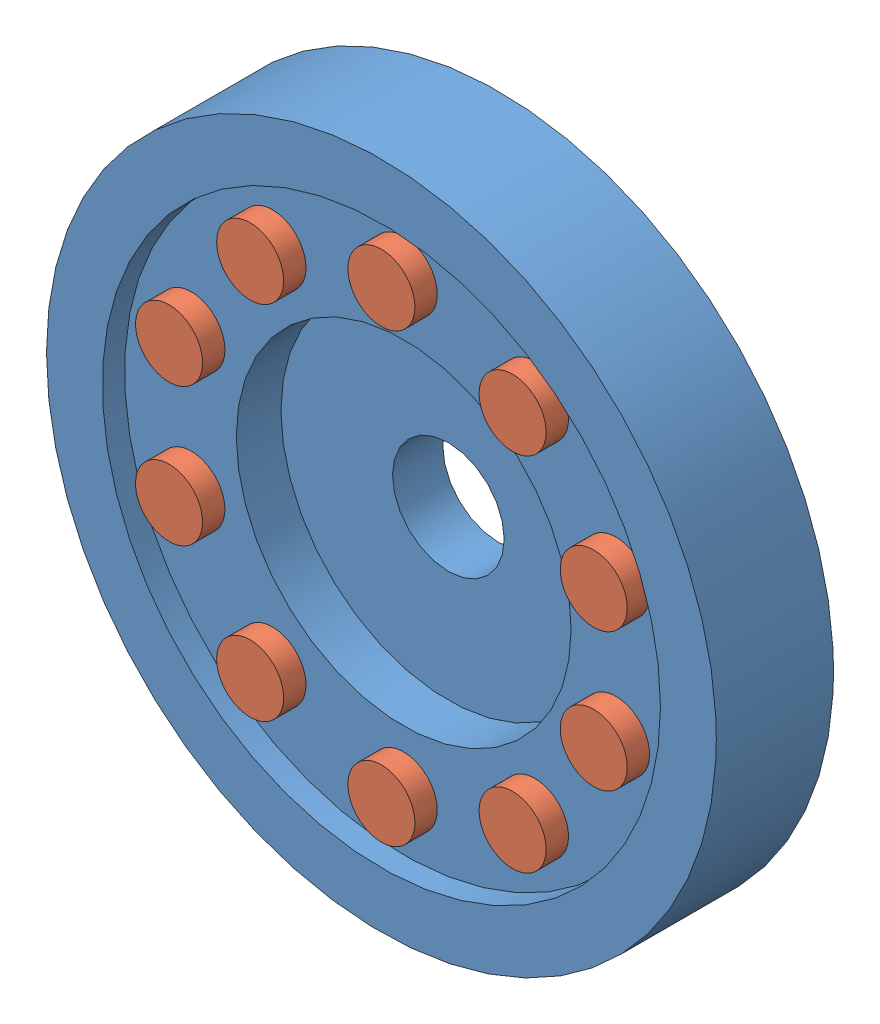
SolidWorks assembly Rotor Housing.SLDASM, configuration Default (file format 7000). Lengths in mm.
Overall size (762 762 133.35).
11 component instances, 2 part files, 20 mates.
Components (placement in the parent):
- Rotor Housing part 1-1: Rotor Housing part 1.SLDPRT [Default] at origin size (762 762 133.35)
- Roller-1: Roller.SLDPRT [Default] at (0 254 41.275) size (76.2 76.2 50.8)
- Roller-2: Roller.SLDPRT [Default] at (241.5684 78.4903 41.275) size (76.2 76.2 50.8)
- Roller-3: Roller.SLDPRT [Default] at (-149.2975 205.4903 41.275) size (76.2 76.2 50.8)
- Roller-4: Roller.SLDPRT [Default] at (-149.2975 -205.4903 41.275) size (76.2 76.2 50.8)
- Roller-5: Roller.SLDPRT [Default] at (149.2975 205.4903 41.275) size (76.2 76.2 50.8)
- Roller-6: Roller.SLDPRT [Default] at (241.5684 -78.4903 41.275) size (76.2 76.2 50.8)
- Roller-7: Roller.SLDPRT [Default] at (0 -254 41.275) size (76.2 76.2 50.8)
- Roller-8: Roller.SLDPRT [Default] at (149.2975 -205.4903 41.275) size (76.2 76.2 50.8)
- Roller-9: Roller.SLDPRT [Default] at (-241.5684 -78.4903 41.275) size (76.2 76.2 50.8)
- Roller-10: Roller.SLDPRT [Default] at (-241.5684 78.4903 41.275) size (76.2 76.2 50.8)
Mates (geometry in assembly coordinates):
- Coincident1: coincident aligned: plane of Roller-1 through (0 254 15.875) normal (0 0 -1); plane of Roller-5 through (149.2975 205.4903 15.875) normal (0 0 -1)
- Coincident2: coincident aligned: plane of Roller-1 through (0 254 15.875) normal (0 0 -1); plane of Roller-2 through (241.5684 78.4903 15.875) normal (0 0 -1)
- Coincident3: coincident aligned: plane of Roller-1 through (0 254 15.875) normal (0 0 -1); plane of Roller-3 through (-149.2975 205.4903 15.875) normal (0 0 -1)
- Coincident4: coincident aligned: plane of Roller-1 through (0 254 15.875) normal (0 0 -1); plane of Roller-4 through (-149.2975 -205.4903 15.875) normal (0 0 -1)
- Coincident5: coincident aligned: plane of Roller-1 through (0 254 15.875) normal (0 0 -1); plane of Roller-6 through (241.5684 -78.4903 15.875) normal (0 0 -1)
- Coincident6: coincident aligned: plane of Roller-1 through (0 254 15.875) normal (0 0 -1); plane of Roller-8 through (149.2975 -205.4903 15.875) normal (0 0 -1)
- Coincident7: coincident aligned: plane of Roller-1 through (0 254 15.875) normal (0 0 -1); plane of Roller-10 through (-241.5684 78.4903 15.875) normal (0 0 -1)
- Coincident8: coincident aligned: plane of Roller-1 through (0 254 15.875) normal (0 0 -1); plane of Roller-7 through (0 -254 15.875) normal (0 0 -1)
- Coincident9: coincident aligned: plane of Roller-1 through (0 254 15.875) normal (0 0 -1); plane of Roller-9 through (-241.5684 -78.4903 15.875) normal (0 0 -1)
- Coincident10: coincident anti-aligned: plane of Roller-1 through (0 254 15.875) normal (0 0 -1); plane of Rotor Housing part 1-1 through (-149.2975 205.4903 15.875) normal (0 0 1)
- Concentric1: concentric anti-aligned: cylinder of Rotor Housing part 1-1 through (-149.2975 205.4903 15.875) axis (0 0 1) radius 38.1; cylinder of Roller-3 through (-149.2975 205.4903 66.675) axis (0 0 -1) radius 38.1
- Concentric2: concentric aligned: cylinder of Rotor Housing part 1-1 through (0 254 15.875) axis (0 0 1) radius 38.1; circle of Roller-1
- Concentric3: concentric anti-aligned: cylinder of Rotor Housing part 1-1 through (149.2975 205.4903 15.875) axis (0 0 1) radius 38.1; cylinder of Roller-5 through (149.2975 205.4903 66.675) axis (0 0 -1) radius 38.1
- Concentric4: concentric anti-aligned: cylinder of Rotor Housing part 1-1 through (241.5684 78.4903 15.875) axis (0 0 1) radius 38.1; cylinder of Roller-2 through (241.5684 78.4903 66.675) axis (0 0 -1) radius 38.1
- Concentric5: concentric anti-aligned: cylinder of Rotor Housing part 1-1 through (241.5684 -78.4903 15.875) axis (0 0 1) radius 38.1; cylinder of Roller-6 through (241.5684 -78.4903 66.675) axis (0 0 -1) radius 38.1
- Concentric6: concentric anti-aligned: cylinder of Rotor Housing part 1-1 through (-241.5684 78.4903 15.875) axis (0 0 1) radius 38.1; cylinder of Roller-10 through (-241.5684 78.4903 66.675) axis (0 0 -1) radius 38.1
- Concentric7: concentric anti-aligned: cylinder of Rotor Housing part 1-1 through (-241.5684 -78.4903 15.875) axis (0 0 1) radius 38.1; cylinder of Roller-9 through (-241.5684 -78.4903 66.675) axis (0 0 -1) radius 38.1
- Concentric8: concentric anti-aligned: cylinder of Rotor Housing part 1-1 through (149.2975 -205.4903 15.875) axis (0 0 1) radius 38.1; cylinder of Roller-8 through (149.2975 -205.4903 66.675) axis (0 0 -1) radius 38.1
- Concentric9: concentric anti-aligned: cylinder of Rotor Housing part 1-1 through (0 -254 15.875) axis (0 0 1) radius 38.1; cylinder of Roller-7 through (0 -254 66.675) axis (0 0 -1) radius 38.1
- Concentric10: concentric anti-aligned: cylinder of Rotor Housing part 1-1 through (-149.2975 -205.4903 15.875) axis (0 0 1) radius 38.1; cylinder of Roller-4 through (-149.2975 -205.4903 66.675) axis (0 0 -1) radius 38.1
